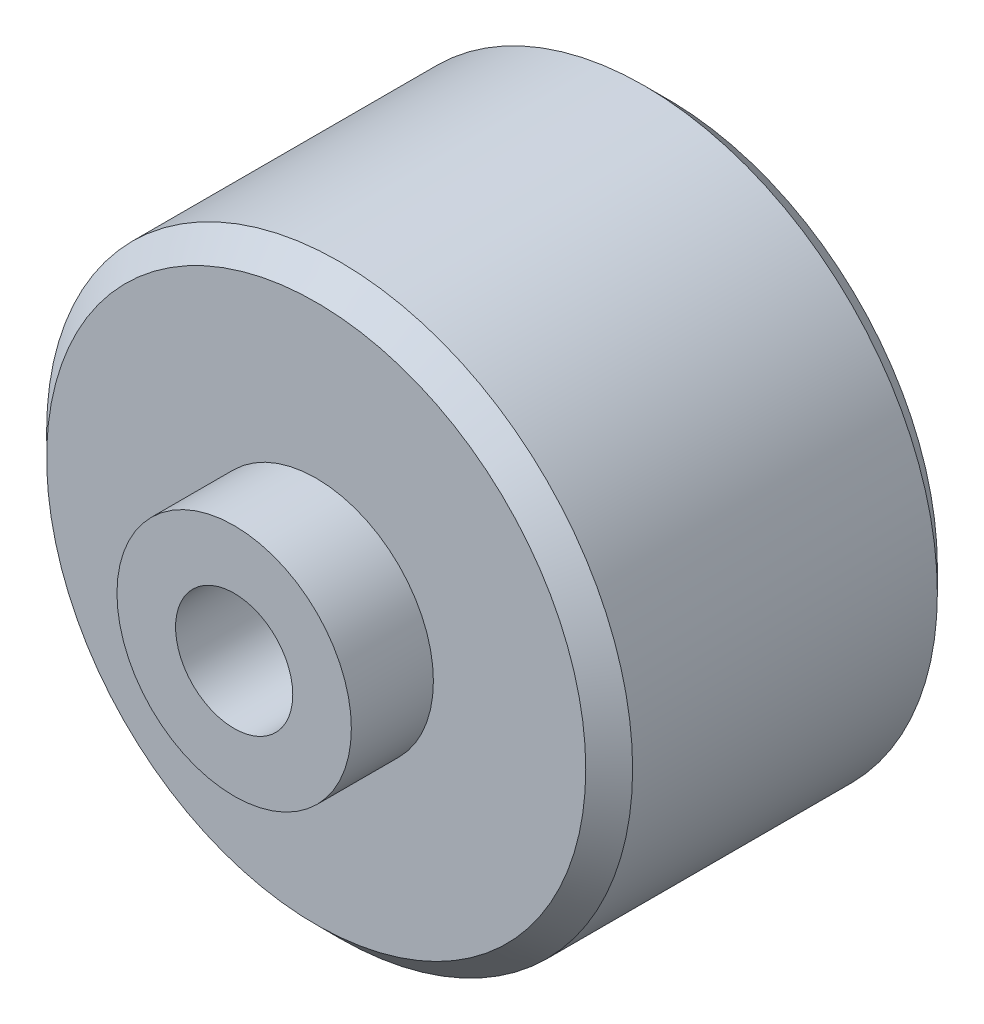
from build123d import *

# Parameters (mm, degrees)
SKETCH1_R      = 12.5
EXTRUDE1_DEPTH = 15
SKETCH2_R      = 5
EXTRUDE2_DEPTH = 3.5
SKETCH3_R      = 2.5
EXTRUDE3_DEPTH = 26.588083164
CHAMFER1_SIZE  = 1


with BuildPart() as part:
    # Sketch1 → Extrude1 (new body)
    with BuildSketch(Plane.XY):
        Circle(SKETCH1_R)
    extrude(amount=EXTRUDE1_DEPTH)

    # Sketch2 → Extrude2 (add)
    with BuildSketch(Plane.XY.offset(15)):
        Circle(SKETCH2_R)
    extrude(amount=EXTRUDE2_DEPTH)

    # Sketch3 → Extrude3 (cut, through all)
    with BuildSketch(Plane.XY.offset(18.5)):
        Circle(SKETCH3_R)
    extrude(amount=-EXTRUDE3_DEPTH, mode=Mode.SUBTRACT)

    # Chamfer1
    chamfer1_edges = [part.edges().sort_by_distance(p)[0] for p in [
        (-12.5, 0, 0),
        (-12.5, 0, 15),
    ]]
    chamfer(chamfer1_edges, length=CHAMFER1_SIZE)


solid = part.part
